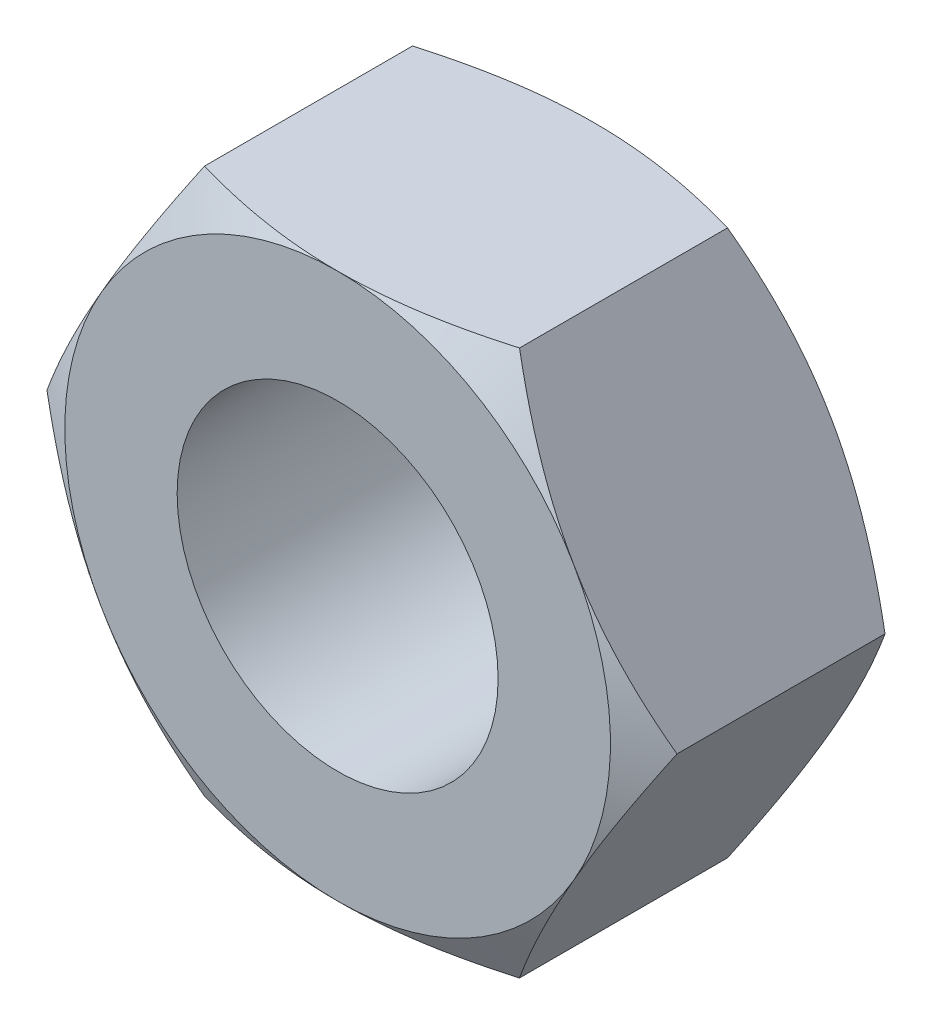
from build123d import *

# Parameters (mm, degrees)
ESQUISSE1_R             = 5
BASE_EXTRUSION_DEPTH    = 4
ESQUISSE2_R             = 12.061361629
ESQUISSE2_R_2           = 8.5
ENL_V_MAT_EXTRU_1_DEPTH = 5
ENL_V_MAT_EXTRU_1_TAPER = 60
ESQUISSE3_R             = 13.471535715
ESQUISSE3_R_2           = 8.5
ENL_V_MAT_EXTRU_2_DEPTH = 5
ENL_V_MAT_EXTRU_2_TAPER = 60


with BuildPart() as part:
    # Esquisse1 → Base-Extrusion (new, symmetric)
    with BuildSketch(Plane.XY):
        Polygon((-4.907477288, -8.5), (-9.814954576, 0), (-4.907477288, 8.5), (4.907477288, 8.5), (9.814954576, 0), (4.907477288, -8.5), align=None)
        Circle(ESQUISSE1_R, mode=Mode.SUBTRACT)
    extrude(amount=BASE_EXTRUSION_DEPTH, both=True)

    # Esquisse2 → Enl_v. mat.-Extru.1 (cut)
    with BuildSketch(Plane(origin=(0, 0, -4), x_dir=(-1, 0, 0), z_dir=(0, 0, -1))):
        Circle(ESQUISSE2_R)
        Circle(ESQUISSE2_R_2, mode=Mode.SUBTRACT)
    extrude(amount=-ENL_V_MAT_EXTRU_1_DEPTH, taper=ENL_V_MAT_EXTRU_1_TAPER, mode=Mode.SUBTRACT)

    # Esquisse3 → Enl_v. mat.-Extru.2 (cut)
    with BuildSketch(Plane.XY.offset(4)):
        Circle(ESQUISSE3_R)
        Circle(ESQUISSE3_R_2, mode=Mode.SUBTRACT)
    extrude(amount=-ENL_V_MAT_EXTRU_2_DEPTH, taper=ENL_V_MAT_EXTRU_2_TAPER, mode=Mode.SUBTRACT)


solid = part.part
